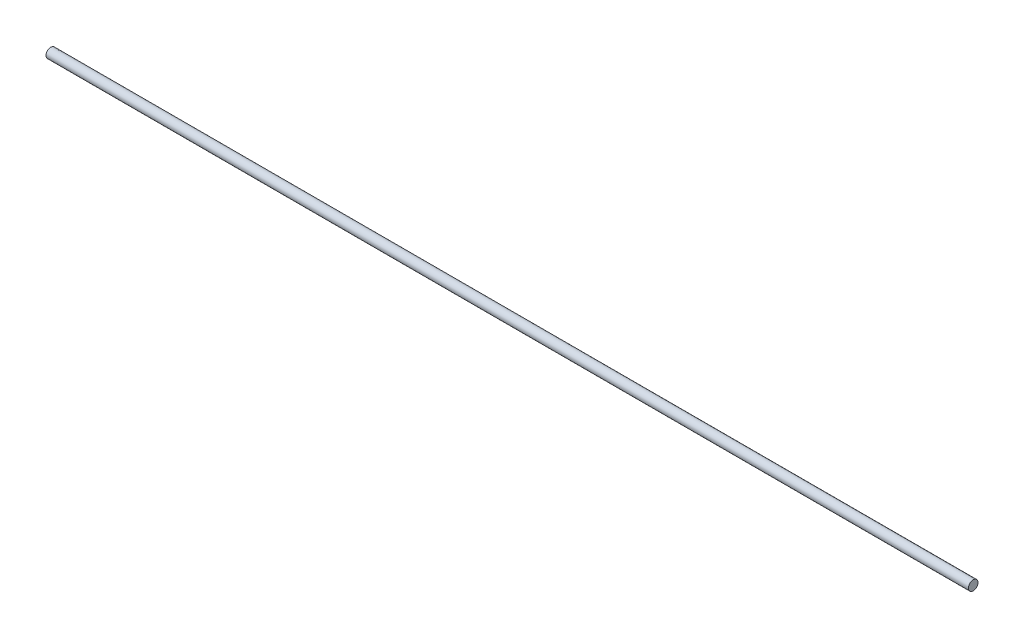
from build123d import *

# Parameters (mm, degrees)
SKIZZE1_R                       = 4
AUFSATZ_LINEAR_AUSTRAGEN1_DEPTH = 385


with BuildPart() as part:
    # Skizze1 → Aufsatz-Linear austragen1 (new, symmetric)
    with BuildSketch(Plane(origin=(0, 0, 0), x_dir=(0, 0, -1), z_dir=(1, 0, 0))):
        Circle(SKIZZE1_R)
    extrude(amount=AUFSATZ_LINEAR_AUSTRAGEN1_DEPTH, both=True)


solid = part.part
